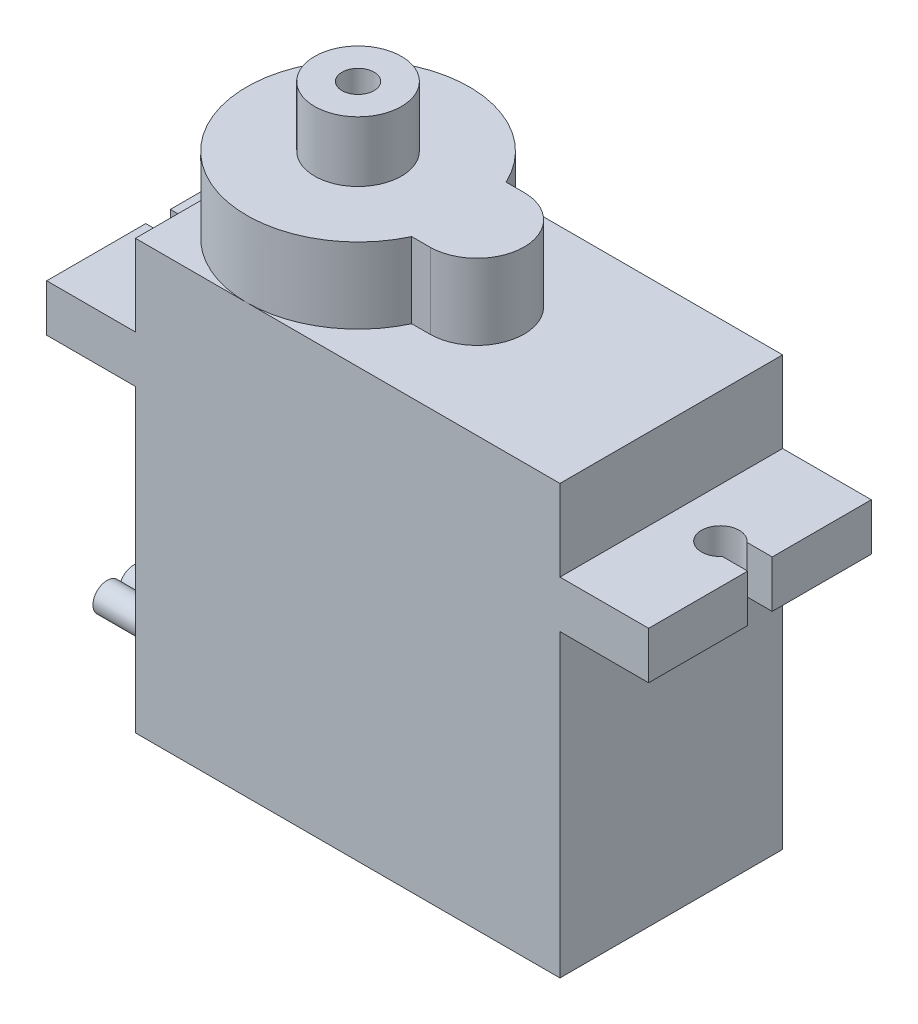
from build123d import *

# Parameters (mm, degrees)
BOSS_EXTRU_1_DEPTH      = 5.9
BOSS_EXTRU_2_DEPTH      = 4
ESQUISSE3_R             = 2.3
ESQUISSE3_R_2           = 0.85
BOSS_EXTRU_3_DEPTH      = 3.2
ENL_V_MAT_EXTRU_1_DEPTH = 3.2
BOSS_EXTRU_4_DEPTH      = 6


with BuildPart() as part:
    # Esquisse1 → Boss.-Extru.1 (new, symmetric)
    with BuildSketch(Plane.XY):
        Polygon((0, 0), (0, 15.9), (-4.7, 15.9), (-4.7, 18.4), (0, 18.4), (0, 22.7), (22.5, 22.7), (22.5, 18.4), (27.2, 18.4), (27.2, 15.9), (22.5, 15.9), (22.5, 0), align=None)
    extrude(amount=BOSS_EXTRU_1_DEPTH, both=True)

    # Esquisse2 → Boss.-Extru.2 (add)
    with BuildSketch(Plane(origin=(0, 22.7, 0), x_dir=(1, 0, 0), z_dir=(0, 1, 0))):
        with BuildLine():
            Line((11.244155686, 2.5), (12.168961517, 2.5))
            ThreePointArc((12.168961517, 2.5), (14.7, 0.031038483), (12.231038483, -2.5))
            Line((12.231038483, -2.5), (11.244155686, -2.5))
            ThreePointArc((11.244155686, -2.5), (0, 0), (11.244155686, 2.5))
        make_face()
    extrude(amount=BOSS_EXTRU_2_DEPTH)

    # Esquisse3 → Boss.-Extru.3 (add)
    with BuildSketch(Plane(origin=(0, 26.7, 0), x_dir=(1, 0, 0), z_dir=(0, 1, 0))):
        with Locations(Location((5.9, 0, 0), (0, 0, 180))):
            Circle(ESQUISSE3_R)
        with Locations(Location((5.9, 0, 0), (0, 0, 180))):
            Circle(ESQUISSE3_R_2, mode=Mode.SUBTRACT)
    extrude(amount=BOSS_EXTRU_3_DEPTH)

    # Esquisse4 → Enl_v. mat.-Extru.1 (cut)
    with BuildSketch(Plane(origin=(0, 18.4, 0), x_dir=(1, 0, 0), z_dir=(0, 1, 0))):
        with BuildLine():
            Line((-6.6354279, 0.65), (-3.359934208, 0.65))
            ThreePointArc((-3.359934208, 0.65), (-1.6, 0), (-3.359934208, -0.65))
            Line((-3.359934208, -0.65), (-6.6354279, -0.65))
            Line((-6.6354279, -0.65), (-6.6354279, 0.65))
        make_face()
        with BuildLine():
            Line((25.859934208, 0.65), (30.600699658, 0.65))
            Line((30.600699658, 0.65), (30.600699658, -0.65))
            Line((30.600699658, -0.65), (25.859934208, -0.65))
            ThreePointArc((25.859934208, -0.65), (24.1, 0), (25.859934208, 0.65))
        make_face()
    extrude(amount=-ENL_V_MAT_EXTRU_1_DEPTH, mode=Mode.SUBTRACT)

    # Esquisse5 → Boss.-Extru.4 (add)
    with BuildSketch(Plane.ZY):
        with BuildLine():
            ThreePointArc((-0.7, 0.73074176), (0, 0.25), (0.7, 0.73074176))
            ThreePointArc((0.7, 0.73074176), (2.15, 1), (0.7, 1.26925824))
            ThreePointArc((0.7, 1.26925824), (0, 1.75), (-0.7, 1.26925824))
            ThreePointArc((-0.7, 1.26925824), (-2.15, 1), (-0.7, 0.73074176))
        make_face()
    extrude(amount=BOSS_EXTRU_4_DEPTH)


solid = part.part
